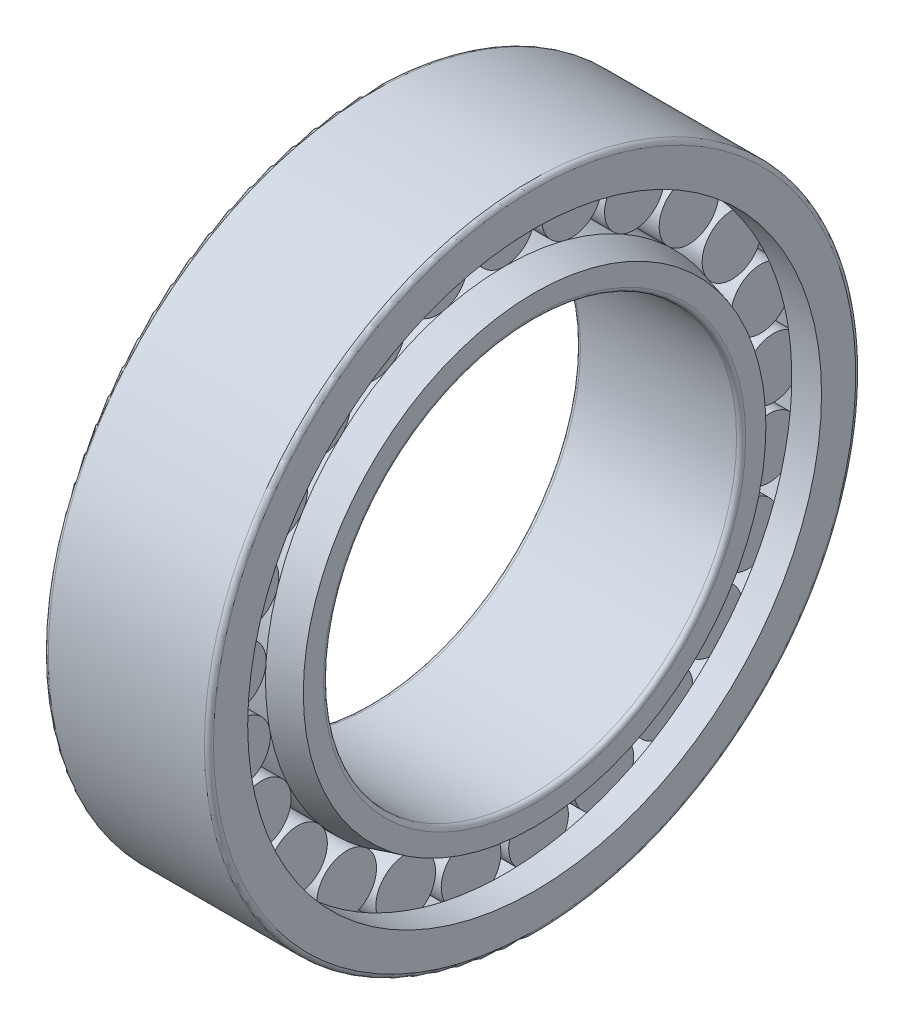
from build123d import *

# Parameters (mm, degrees)
SKETCH2_W               = 7.378821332
SKETCH2_H               = 7.232102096
CIRCULAR_PATTERN1_COUNT = 25


with BuildPart() as part:
    # Sketch1 → Revolve1 (revolve)
    with BuildSketch(Plane.XY, mode=Mode.PRIVATE) as revolve1_sk:
        with BuildLine():
            Line((12.787897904, 57.933312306), (20, 56.000835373))
            Line((20, 56.000835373), (20, 51.1))
            ThreePointArc((20, 51.1), (19.677817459, 50.322182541), (18.9, 50))
            Line((18.9, 50), (-18.9, 50))
            ThreePointArc((-18.9, 50), (-19.677817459, 50.322182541), (-20, 51.1))
            Line((-20, 51.1), (-20, 56.000835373))
            Line((-20, 56.000835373), (-12.787897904, 57.933312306))
            Line((-12.787897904, 57.933312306), (12.787897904, 57.933312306))
        make_face()
    revolve(revolve1_sk.sketch.rotate(Axis((0, 0, 0), (1, 0, 0)), 90), axis=Axis((0, 0, 0), (1, 0, 0)))

    # Sketch2 → Revolve2 (revolve)
    with BuildSketch(Plane.XY):
        with Locations((9.098487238, 68.76146545)):
            Rectangle(SKETCH2_W, SKETCH2_H)
        with Locations((-9.098487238, 68.76146545)):
            Rectangle(SKETCH2_W, SKETCH2_H)
    revolve2 = revolve(axis=Axis((5.409076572, 65.145414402, 0), (-1, 0, 0)))

    # Sketch3 → Revolve3 (revolve)
    with BuildSketch(Plane.XY, mode=Mode.PRIVATE) as revolve3_sk:
        with BuildLine():
            Line((-20, 69.47267566), (-12.787897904, 69.47267566))
            Line((-12.787897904, 69.47267566), (-12.787897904, 72.357516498))
            Line((-12.787897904, 72.357516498), (-5.409076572, 72.357516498))
            Line((-5.409076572, 72.357516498), (-5.409076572, 69.47267566))
            Line((-5.409076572, 69.47267566), (5.409076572, 69.47267566))
            Line((5.409076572, 69.47267566), (5.409076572, 72.357516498))
            Line((5.409076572, 72.357516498), (12.787897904, 72.357516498))
            Line((12.787897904, 72.357516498), (12.787897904, 69.47267566))
            Line((12.787897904, 69.47267566), (20, 69.47267566))
            Line((20, 69.47267566), (20, 77.748408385))
            ThreePointArc((20, 77.748408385), (19.677817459, 78.526225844), (18.9, 78.848408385))
            Line((18.9, 78.848408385), (-18.9, 78.848408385))
            ThreePointArc((-18.9, 78.848408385), (-19.677817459, 78.526225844), (-20, 77.748408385))
            Line((-20, 77.748408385), (-20, 69.47267566))
        make_face()
    revolve(revolve3_sk.sketch.rotate(Axis((0, 0, 0), (1, 0, 0)), 90), axis=Axis((0, 0, 0), (1, 0, 0)))

    # Circular-Pattern1: Revolve2 ×25 about axis
    circular_pattern1_axis = Axis((0, 0, 0), (1, 0, 0))
    for i in range(1, CIRCULAR_PATTERN1_COUNT):
        add(revolve2.rotate(circular_pattern1_axis, i * 360 / CIRCULAR_PATTERN1_COUNT))


solid = part.part
